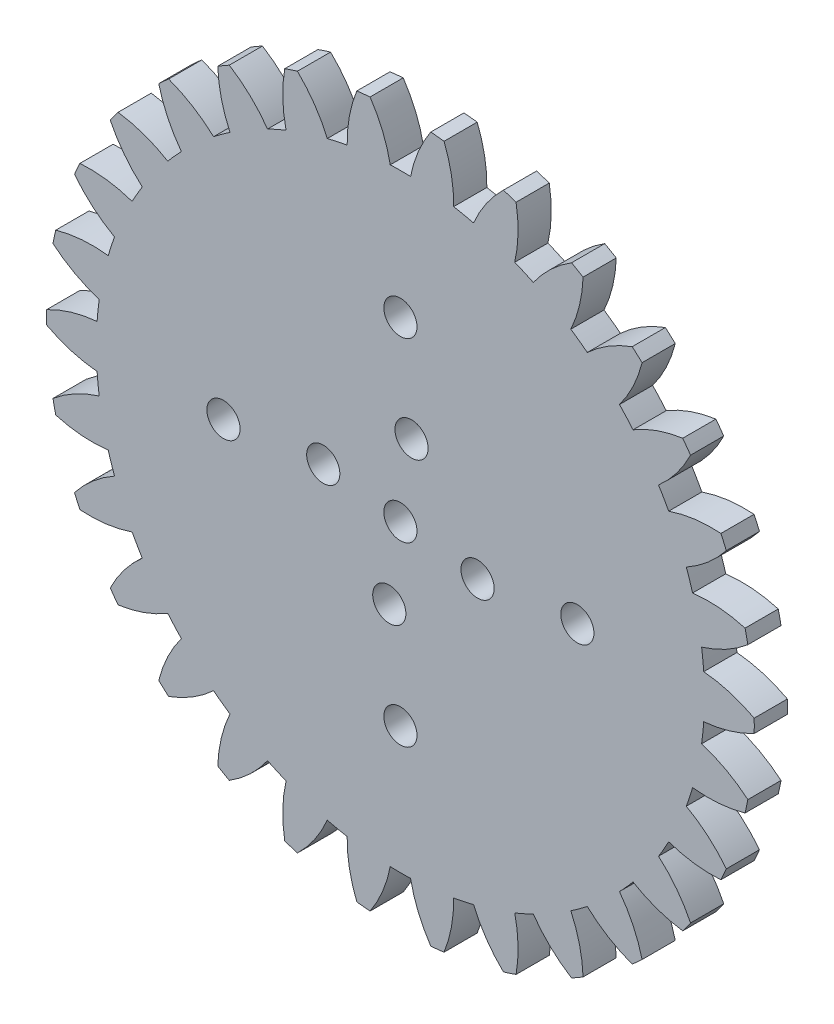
from build123d import *

# Parameters (mm, degrees)
EXTRUDE_1_DEPTH     = 3
SKETCH_2_R          = 1.5
CUT_EXTRUDE_1_DEPTH = 10
SKETCH_3_R          = 1.5
CUT_EXTRUDE_2_DEPTH = 10
CUT_EXTRUDE_3_REACH = 123.605
SKETCH_5_R          = 1.5


with BuildPart() as part:
    # Sketch 1 → Extrude 1 (new body)
    with BuildSketch(Plane.XY):
        with BuildLine():
            ThreePointArc((-88.734632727, 50.605995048), (-86.520028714, 49.698643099), (-84.169409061, 49.24881453))
            ThreePointArc((-84.169409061, 49.24881453), (-84.088655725, 48.333690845), (-83.977379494, 47.421775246))
            ThreePointArc((-83.977379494, 47.421775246), (-86.18310785, 46.493055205), (-88.160668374, 45.145089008))
            ThreePointArc((-88.160668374, 45.145089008), (-88.041021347, 44.554944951), (-87.910291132, 43.967156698))
            ThreePointArc((-87.910291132, 43.967156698), (-85.555432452, 43.540074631), (-83.16265486, 43.588797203))
            ThreePointArc((-83.16265486, 43.588797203), (-82.893401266, 42.710460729), (-82.594958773, 41.841608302))
            ThreePointArc((-82.594958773, 41.841608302), (-84.559394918, 40.47458631), (-86.213483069, 38.744918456))
            ThreePointArc((-86.213483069, 38.744918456), (-85.973752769, 38.192546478), (-85.723671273, 37.64478315))
            ThreePointArc((-85.723671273, 37.64478315), (-83.33147655, 37.7166365), (-81.001116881, 38.261780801))
            ThreePointArc((-81.001116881, 38.261780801), (-80.555130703, 37.458619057), (-80.082565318, 36.670802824))
            ThreePointArc((-80.082565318, 36.670802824), (-81.719853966, 34.925224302), (-82.978178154, 32.889449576))
            ThreePointArc((-82.978178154, 32.889449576), (-82.628841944, 32.398990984), (-82.270338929, 31.915192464))
            ThreePointArc((-82.270338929, 31.915192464), (-79.945358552, 32.482840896), (-77.779264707, 33.500581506))
            ThreePointArc((-77.779264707, 33.500581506), (-77.17603768, 32.807696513), (-76.550002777, 32.135347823))
            ThreePointArc((-76.550002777, 32.135347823), (-77.788586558, 30.087502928), (-78.596151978, 27.834594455))
            ThreePointArc((-78.596151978, 27.834594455), (-78.152477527, 27.427484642), (-77.701221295, 27.028795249))
            ThreePointArc((-77.701221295, 27.028795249), (-75.545068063, 28.067429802), (-73.637908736, 29.513286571))
            ThreePointArc((-73.637908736, 29.513286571), (-72.903804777, 28.960960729), (-72.151661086, 28.433464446))
            ThreePointArc((-72.151661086, 28.433464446), (-72.937407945, 26.172853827), (-73.258920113, 23.801274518))
            ThreePointArc((-73.258920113, 23.801274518), (-72.740298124, 23.495306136), (-72.216010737, 23.199150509))
            ThreePointArc((-72.216010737, 23.199150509), (-70.322918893, 24.663377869), (-68.758046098, 26.474159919))
            ThreePointArc((-68.758046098, 26.474159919), (-67.925149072, 26.086532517), (-67.079768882, 25.72694276))
            ThreePointArc((-67.079768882, 25.72694276), (-67.37833791, 23.35236595), (-67.199745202, 20.9657652))
            ThreePointArc((-67.199745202, 20.9657652), (-66.628841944, 20.774310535), (-66.054437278, 20.593632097))
            ThreePointArc((-66.054437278, 20.593632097), (-64.507144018, 22.419458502), (-63.352950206, 24.516025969))
            ThreePointArc((-63.352950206, 24.516025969), (-62.45766171, 24.310038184), (-61.55599219, 24.134070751))
            ThreePointArc((-61.55599219, 24.134070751), (-61.35433449, 21.749308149), (-60.683442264, 19.451991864))
            ThreePointArc((-60.683442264, 19.451991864), (-60.085208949, 19.383418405), (-59.485791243, 19.326113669))
            ThreePointArc((-59.485791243, 19.326113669), (-58.351920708, 21.433741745), (-57.658849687, 23.724464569))
            ThreePointArc((-57.658849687, 23.724464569), (-56.740298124, 23.709119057), (-55.82174656, 23.724464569))
            ThreePointArc((-55.82174656, 23.724464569), (-55.12867554, 21.433741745), (-53.994805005, 19.326113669))
            ThreePointArc((-53.994805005, 19.326113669), (-53.395387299, 19.383418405), (-52.797153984, 19.451991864))
            ThreePointArc((-52.797153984, 19.451991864), (-52.126261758, 21.749308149), (-51.924604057, 24.134070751))
            ThreePointArc((-51.924604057, 24.134070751), (-51.022934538, 24.310038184), (-50.127646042, 24.516025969))
            ThreePointArc((-50.127646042, 24.516025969), (-48.97345223, 22.419458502), (-47.42615897, 20.593632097))
            ThreePointArc((-47.42615897, 20.593632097), (-46.851754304, 20.774310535), (-46.280851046, 20.9657652))
            ThreePointArc((-46.280851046, 20.9657652), (-46.102258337, 23.35236595), (-46.400827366, 25.72694276))
            ThreePointArc((-46.400827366, 25.72694276), (-45.555447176, 26.086532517), (-44.72255015, 26.474159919))
            ThreePointArc((-44.72255015, 26.474159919), (-43.157677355, 24.663377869), (-41.264585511, 23.199150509))
            ThreePointArc((-41.264585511, 23.199150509), (-40.740298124, 23.495306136), (-40.221676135, 23.801274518))
            ThreePointArc((-40.221676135, 23.801274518), (-40.543188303, 26.172853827), (-41.328935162, 28.433464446))
            ThreePointArc((-41.328935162, 28.433464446), (-40.576791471, 28.960960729), (-39.842687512, 29.513286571))
            ThreePointArc((-39.842687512, 29.513286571), (-37.935528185, 28.067429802), (-35.779374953, 27.028795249))
            ThreePointArc((-35.779374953, 27.028795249), (-35.32811872, 27.427484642), (-34.88444427, 27.834594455))
            ThreePointArc((-34.88444427, 27.834594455), (-35.69200969, 30.087502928), (-36.930593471, 32.135347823))
            ThreePointArc((-36.930593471, 32.135347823), (-36.304558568, 32.807696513), (-35.701331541, 33.500581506))
            ThreePointArc((-35.701331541, 33.500581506), (-33.535237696, 32.482840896), (-31.210257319, 31.915192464))
            ThreePointArc((-31.210257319, 31.915192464), (-30.851754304, 32.398990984), (-30.502418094, 32.889449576))
            ThreePointArc((-30.502418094, 32.889449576), (-31.760742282, 34.925224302), (-33.39803093, 36.670802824))
            ThreePointArc((-33.39803093, 36.670802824), (-32.925465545, 37.458619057), (-32.479479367, 38.261780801))
            ThreePointArc((-32.479479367, 38.261780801), (-30.149119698, 37.7166365), (-27.756924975, 37.64478315))
            ThreePointArc((-27.756924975, 37.64478315), (-27.506843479, 38.192546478), (-27.267113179, 38.744918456))
            ThreePointArc((-27.267113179, 38.744918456), (-28.92120133, 40.47458631), (-30.885637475, 41.841608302))
            ThreePointArc((-30.885637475, 41.841608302), (-30.587194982, 42.710460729), (-30.317941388, 43.588797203))
            ThreePointArc((-30.317941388, 43.588797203), (-27.925163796, 43.540074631), (-25.570305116, 43.967156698))
            ThreePointArc((-25.570305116, 43.967156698), (-25.4395749, 44.554944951), (-25.319927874, 45.145089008))
            ThreePointArc((-25.319927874, 45.145089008), (-27.297488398, 46.493055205), (-29.503216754, 47.421775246))
            ThreePointArc((-29.503216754, 47.421775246), (-29.391940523, 48.333690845), (-29.311187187, 49.24881453))
            ThreePointArc((-29.311187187, 49.24881453), (-26.960567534, 49.698643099), (-24.745963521, 50.605995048))
            ThreePointArc((-24.745963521, 50.605995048), (-24.740298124, 51.208119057), (-24.745963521, 51.810243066))
            ThreePointArc((-24.745963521, 51.810243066), (-26.960567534, 52.717595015), (-29.311187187, 53.167423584))
            ThreePointArc((-29.311187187, 53.167423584), (-29.391940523, 54.082547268), (-29.503216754, 54.994462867))
            ThreePointArc((-29.503216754, 54.994462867), (-27.297488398, 55.923182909), (-25.319927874, 57.271149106))
            ThreePointArc((-25.319927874, 57.271149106), (-25.4395749, 57.861293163), (-25.570305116, 58.449081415))
            ThreePointArc((-25.570305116, 58.449081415), (-27.925163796, 58.876163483), (-30.317941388, 58.827440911))
            ThreePointArc((-30.317941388, 58.827440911), (-30.587194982, 59.705777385), (-30.885637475, 60.574629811))
            ThreePointArc((-30.885637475, 60.574629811), (-28.92120133, 61.941651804), (-27.267113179, 63.671319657))
            ThreePointArc((-27.267113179, 63.671319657), (-27.506843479, 64.223691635), (-27.756924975, 64.771454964))
            ThreePointArc((-27.756924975, 64.771454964), (-30.149119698, 64.699601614), (-32.479479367, 64.154457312))
            ThreePointArc((-32.479479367, 64.154457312), (-32.925465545, 64.957619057), (-33.39803093, 65.74543529))
            ThreePointArc((-33.39803093, 65.74543529), (-31.760742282, 67.491013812), (-30.502418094, 69.526788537))
            ThreePointArc((-30.502418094, 69.526788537), (-30.851754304, 70.01724713), (-31.210257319, 70.501045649))
            ThreePointArc((-31.210257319, 70.501045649), (-33.535237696, 69.933397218), (-35.701331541, 68.915656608))
            ThreePointArc((-35.701331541, 68.915656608), (-36.304558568, 69.608541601), (-36.930593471, 70.280890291))
            ThreePointArc((-36.930593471, 70.280890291), (-35.69200969, 72.328735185), (-34.88444427, 74.581643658))
            ThreePointArc((-34.88444427, 74.581643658), (-35.32811872, 74.988753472), (-35.779374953, 75.387442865))
            ThreePointArc((-35.779374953, 75.387442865), (-37.935528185, 74.348808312), (-39.842687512, 72.902951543))
            ThreePointArc((-39.842687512, 72.902951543), (-40.576791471, 73.455277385), (-41.328935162, 73.982773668))
            ThreePointArc((-41.328935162, 73.982773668), (-40.543188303, 76.243384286), (-40.221676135, 78.614963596))
            ThreePointArc((-40.221676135, 78.614963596), (-40.740298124, 78.920931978), (-41.264585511, 79.217087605))
            ThreePointArc((-41.264585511, 79.217087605), (-43.157677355, 77.752860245), (-44.72255015, 75.942078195))
            ThreePointArc((-44.72255015, 75.942078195), (-45.555447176, 76.329705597), (-46.400827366, 76.689295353))
            ThreePointArc((-46.400827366, 76.689295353), (-46.102258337, 79.063872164), (-46.280851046, 81.450472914))
            ThreePointArc((-46.280851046, 81.450472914), (-46.851754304, 81.641927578), (-47.42615897, 81.822606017))
            ThreePointArc((-47.42615897, 81.822606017), (-48.97345223, 79.996779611), (-50.127646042, 77.900212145))
            ThreePointArc((-50.127646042, 77.900212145), (-51.022934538, 78.106199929), (-51.924604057, 78.282167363))
            ThreePointArc((-51.924604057, 78.282167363), (-52.126261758, 80.666929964), (-52.797153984, 82.96424625))
            ThreePointArc((-52.797153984, 82.96424625), (-53.395387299, 83.032819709), (-53.994805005, 83.090124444))
            ThreePointArc((-53.994805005, 83.090124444), (-55.12867554, 80.982496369), (-55.82174656, 78.691773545))
            ThreePointArc((-55.82174656, 78.691773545), (-56.740298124, 78.707119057), (-57.658849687, 78.691773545))
            ThreePointArc((-57.658849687, 78.691773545), (-58.351920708, 80.982496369), (-59.485791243, 83.090124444))
            ThreePointArc((-59.485791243, 83.090124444), (-60.085208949, 83.032819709), (-60.683442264, 82.96424625))
            ThreePointArc((-60.683442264, 82.96424625), (-61.35433449, 80.666929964), (-61.55599219, 78.282167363))
            ThreePointArc((-61.55599219, 78.282167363), (-62.45766171, 78.106199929), (-63.352950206, 77.900212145))
            ThreePointArc((-63.352950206, 77.900212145), (-64.507144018, 79.996779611), (-66.054437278, 81.822606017))
            ThreePointArc((-66.054437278, 81.822606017), (-66.628841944, 81.641927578), (-67.199745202, 81.450472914))
            ThreePointArc((-67.199745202, 81.450472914), (-67.37833791, 79.063872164), (-67.079768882, 76.689295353))
            ThreePointArc((-67.079768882, 76.689295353), (-67.925149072, 76.329705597), (-68.758046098, 75.942078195))
            ThreePointArc((-68.758046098, 75.942078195), (-70.322918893, 77.752860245), (-72.216010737, 79.217087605))
            ThreePointArc((-72.216010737, 79.217087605), (-72.740298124, 78.920931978), (-73.258920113, 78.614963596))
            ThreePointArc((-73.258920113, 78.614963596), (-72.937407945, 76.243384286), (-72.151661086, 73.982773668))
            ThreePointArc((-72.151661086, 73.982773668), (-72.903804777, 73.455277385), (-73.637908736, 72.902951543))
            ThreePointArc((-73.637908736, 72.902951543), (-75.545068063, 74.348808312), (-77.701221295, 75.387442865))
            ThreePointArc((-77.701221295, 75.387442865), (-78.152477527, 74.988753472), (-78.596151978, 74.581643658))
            ThreePointArc((-78.596151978, 74.581643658), (-77.788586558, 72.328735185), (-76.550002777, 70.280890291))
            ThreePointArc((-76.550002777, 70.280890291), (-77.17603768, 69.608541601), (-77.779264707, 68.915656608))
            ThreePointArc((-77.779264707, 68.915656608), (-79.945358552, 69.933397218), (-82.270338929, 70.501045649))
            ThreePointArc((-82.270338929, 70.501045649), (-82.628841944, 70.01724713), (-82.978178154, 69.526788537))
            ThreePointArc((-82.978178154, 69.526788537), (-81.719853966, 67.491013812), (-80.082565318, 65.74543529))
            ThreePointArc((-80.082565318, 65.74543529), (-80.555130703, 64.957619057), (-81.001116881, 64.154457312))
            ThreePointArc((-81.001116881, 64.154457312), (-83.33147655, 64.699601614), (-85.723671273, 64.771454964))
            ThreePointArc((-85.723671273, 64.771454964), (-85.973752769, 64.223691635), (-86.213483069, 63.671319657))
            ThreePointArc((-86.213483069, 63.671319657), (-84.559394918, 61.941651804), (-82.594958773, 60.574629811))
            ThreePointArc((-82.594958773, 60.574629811), (-82.893401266, 59.705777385), (-83.16265486, 58.827440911))
            ThreePointArc((-83.16265486, 58.827440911), (-85.555432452, 58.876163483), (-87.910291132, 58.449081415))
            ThreePointArc((-87.910291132, 58.449081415), (-88.041021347, 57.861293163), (-88.160668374, 57.271149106))
            ThreePointArc((-88.160668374, 57.271149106), (-86.18310785, 55.923182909), (-83.977379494, 54.994462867))
            ThreePointArc((-83.977379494, 54.994462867), (-84.088655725, 54.082547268), (-84.169409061, 53.167423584))
            ThreePointArc((-84.169409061, 53.167423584), (-86.520028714, 52.717595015), (-88.734632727, 51.810243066))
            ThreePointArc((-88.734632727, 51.810243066), (-88.740298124, 51.208119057), (-88.734632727, 50.605995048))
        make_face()
    extrude(amount=EXTRUDE_1_DEPTH)

    # Sketch 2 → Cut-Extrude 1 (cut)
    with BuildSketch(Plane.XY.offset(3)):
        with Locations((-56.740298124, 67.208119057)):
            Circle(SKETCH_2_R)
        with Locations((-40.740298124, 51.208119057)):
            Circle(SKETCH_2_R)
        with Locations((-56.740298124, 35.208119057)):
            Circle(SKETCH_2_R)
        with Locations((-72.740298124, 51.208119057)):
            Circle(SKETCH_2_R)
    extrude(amount=-CUT_EXTRUDE_1_DEPTH, mode=Mode.SUBTRACT)

    # Sketch 3 → Cut-Extrude 2 (cut)
    with BuildSketch(Plane.XY.offset(3)):
        with Locations((-56.740298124, 51.208119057)):
            Circle(SKETCH_3_R)
    extrude(amount=-CUT_EXTRUDE_2_DEPTH, mode=Mode.SUBTRACT)

    # Sketch 5 → Cut-Extrude 3 (cut, up to next)
    with BuildSketch(Plane.XY.offset(3), mode=Mode.PRIVATE) as cut_extrude_3_sk1:
        with Locations((-49.762404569, 50.202384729)):
            Circle(SKETCH_5_R)
    cut_extrude_3_tool1 = extrude(cut_extrude_3_sk1.sketch, amount=-CUT_EXTRUDE_3_REACH, mode=Mode.PRIVATE) & part.part
    # Sketch 5 → Cut-Extrude 3 (cut, up to next)
    with BuildSketch(Plane.XY.offset(3), mode=Mode.PRIVATE) as cut_extrude_3_sk2:
        with Locations((-55.734563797, 58.186012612)):
            Circle(SKETCH_5_R)
    cut_extrude_3_tool2 = extrude(cut_extrude_3_sk2.sketch, amount=-CUT_EXTRUDE_3_REACH, mode=Mode.PRIVATE) & part.part
    # Sketch 5 → Cut-Extrude 3 (cut, up to next)
    with BuildSketch(Plane.XY.offset(3), mode=Mode.PRIVATE) as cut_extrude_3_sk3:
        with Locations((-63.718191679, 52.213853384)):
            Circle(SKETCH_5_R)
    cut_extrude_3_tool3 = extrude(cut_extrude_3_sk3.sketch, amount=-CUT_EXTRUDE_3_REACH, mode=Mode.PRIVATE) & part.part
    # Sketch 5 → Cut-Extrude 3 (cut, up to next)
    with BuildSketch(Plane.XY.offset(3), mode=Mode.PRIVATE) as cut_extrude_3_sk4:
        with Locations((-57.746032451, 44.230225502)):
            Circle(SKETCH_5_R)
    cut_extrude_3_tool4 = extrude(cut_extrude_3_sk4.sketch, amount=-CUT_EXTRUDE_3_REACH, mode=Mode.PRIVATE) & part.part
    add(cut_extrude_3_tool1.solids().sort_by_distance((-49.762405, 50.202385, 3))[0], mode=Mode.SUBTRACT)
    add(cut_extrude_3_tool2.solids().sort_by_distance((-55.734564, 58.186013, 3))[0], mode=Mode.SUBTRACT)
    add(cut_extrude_3_tool3.solids().sort_by_distance((-63.718192, 52.213853, 3))[0], mode=Mode.SUBTRACT)
    add(cut_extrude_3_tool4.solids().sort_by_distance((-57.746032, 44.230226, 3))[0], mode=Mode.SUBTRACT)


solid = part.part
